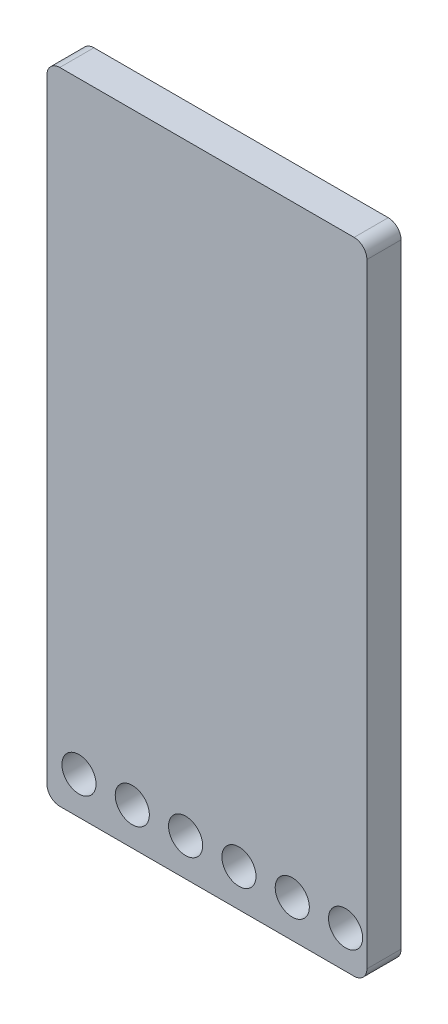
from build123d import *

# Parameters (mm, degrees)
Y_KSEKLIK_EKSTR_ZYON1_DEPTH = 1.6
IZIM3_R                     = 0.8
KES_EKSTR_ZYON1_DEPTH       = 1.6


with BuildPart() as part:
    # izim1 → Y_kseklik-Ekstr_zyon1 (new body)
    with BuildSketch(Plane.XY):
        with BuildLine():
            Line((-6.9, -15), (6.9, -15))
            ThreePointArc((6.9, -15), (7.324264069, -14.824264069), (7.5, -14.4))
            Line((7.5, -14.4), (7.5, 14.4))
            ThreePointArc((7.5, 14.4), (7.324264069, 14.824264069), (6.9, 15))
            Line((6.9, 15), (-6.9, 15))
            ThreePointArc((-6.9, 15), (-7.324264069, 14.824264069), (-7.5, 14.4))
            Line((-7.5, 14.4), (-7.5, -14.4))
            ThreePointArc((-7.5, -14.4), (-7.324264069, -14.824264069), (-6.9, -15))
        make_face()
    extrude(amount=Y_KSEKLIK_EKSTR_ZYON1_DEPTH)

    # izim3 → Kes-Ekstr_zyon1 (cut)
    with BuildSketch(Plane(origin=(0, 0, 0), x_dir=(-1, 0, 0), z_dir=(0, 0, -1))):
        with Locations((-6.5, -13.247254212)):
            Circle(IZIM3_R)
        with Locations((-4, -13.247254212)):
            Circle(IZIM3_R)
        with Locations((-1.5, -13.247254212)):
            Circle(IZIM3_R)
        with Locations((1, -13.247254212)):
            Circle(IZIM3_R)
        with Locations((3.5, -13.247254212)):
            Circle(IZIM3_R)
        with Locations((6, -13.247254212)):
            Circle(IZIM3_R)
    extrude(amount=-KES_EKSTR_ZYON1_DEPTH, mode=Mode.SUBTRACT)


solid = part.part
